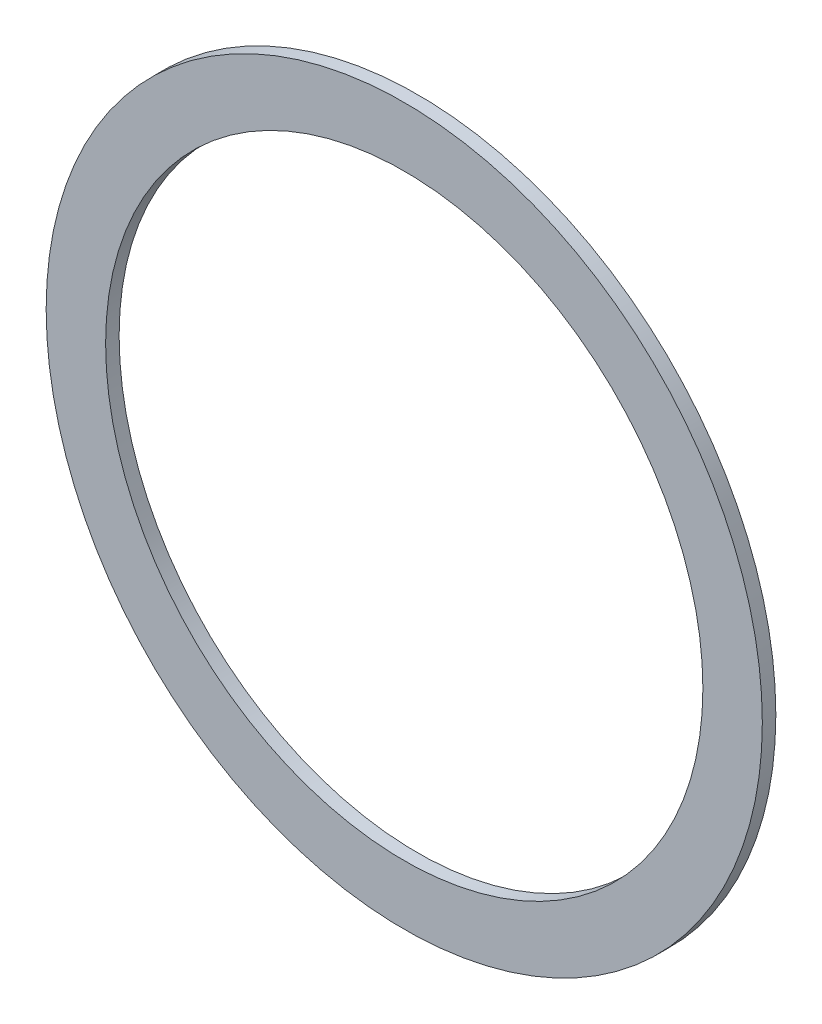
ISO-10303-21;
HEADER;
FILE_DESCRIPTION(('STEP AP214'),'2;1');
FILE_NAME('part.step','',(''),(''),'','','');
FILE_SCHEMA(('AUTOMOTIVE_DESIGN { 1 0 10303 214 1 1 1 1 }'));
ENDSEC;
DATA;
#1=APPLICATION_CONTEXT('core data for automotive mechanical design processes');
#2=APPLICATION_PROTOCOL_DEFINITION('international standard','automotive_design',2000,#1);
#3=PRODUCT_CONTEXT('',#1,'mechanical');
#4=PRODUCT('Part','Part','',(#3));
#5=PRODUCT_RELATED_PRODUCT_CATEGORY('part','',(#4));
#6=PRODUCT_DEFINITION_FORMATION('','',#4);
#7=PRODUCT_DEFINITION_CONTEXT('part definition',#1,'design');
#8=PRODUCT_DEFINITION('design','',#6,#7);
#9=PRODUCT_DEFINITION_SHAPE('','',#8);
#10=(LENGTH_UNIT() NAMED_UNIT(*) SI_UNIT(.MILLI.,.METRE.));
#11=(NAMED_UNIT(*) PLANE_ANGLE_UNIT() SI_UNIT($,.RADIAN.));
#12=(NAMED_UNIT(*) SI_UNIT($,.STERADIAN.) SOLID_ANGLE_UNIT());
#13=UNCERTAINTY_MEASURE_WITH_UNIT(LENGTH_MEASURE(1.E-05),#10,'distance_accuracy_value','');
#14=(GEOMETRIC_REPRESENTATION_CONTEXT(3) GLOBAL_UNCERTAINTY_ASSIGNED_CONTEXT((#13)) GLOBAL_UNIT_ASSIGNED_CONTEXT((#10,
#11,#12)) REPRESENTATION_CONTEXT('',''));
#15=CARTESIAN_POINT('',(0.,0.,0.));
#16=DIRECTION('',(0.,0.,1.));
#17=DIRECTION('',(1.,0.,0.));
#18=AXIS2_PLACEMENT_3D('',#15,#16,#17);
#19=CARTESIAN_POINT('',(0.,0.,0.5));
#20=DIRECTION('',(0.,0.,1.));
#21=DIRECTION('',(1.,0.,0.));
#22=AXIS2_PLACEMENT_3D('',#19,#20,#21);
#23=PLANE('',#22);
#24=CARTESIAN_POINT('',(0.,0.,0.5));
#25=DIRECTION('',(0.,0.,1.));
#26=DIRECTION('',(1.,0.,0.));
#27=AXIS2_PLACEMENT_3D('',#24,#25,#26);
#28=CIRCLE('',#27,13.25);
#29=CARTESIAN_POINT('',(13.25,0.,0.5));
#30=VERTEX_POINT('',#29);
#31=EDGE_CURVE('E10',#30,#30,#28,.T.);
#32=ORIENTED_EDGE('',*,*,#31,.T.);
#33=EDGE_LOOP('',(#32));
#34=FACE_BOUND('',#33,.T.);
#35=CARTESIAN_POINT('',(0.,0.,0.5));
#36=DIRECTION('',(0.,0.,1.));
#37=DIRECTION('',(1.,0.,0.));
#38=AXIS2_PLACEMENT_3D('',#35,#36,#37);
#39=CIRCLE('',#38,11.05);
#40=CARTESIAN_POINT('',(11.05,0.,0.5));
#41=VERTEX_POINT('',#40);
#42=EDGE_CURVE('E25',#41,#41,#39,.T.);
#43=ORIENTED_EDGE('',*,*,#42,.F.);
#44=EDGE_LOOP('',(#43));
#45=FACE_BOUND('',#44,.T.);
#46=ADVANCED_FACE('F14',(#34,#45),#23,.T.);
#47=CARTESIAN_POINT('',(0.,0.,0.));
#48=DIRECTION('',(0.,0.,1.));
#49=DIRECTION('',(1.,0.,0.));
#50=AXIS2_PLACEMENT_3D('',#47,#48,#49);
#51=PLANE('',#50);
#52=CARTESIAN_POINT('',(0.,0.,0.));
#53=DIRECTION('',(0.,0.,1.));
#54=DIRECTION('',(1.,0.,0.));
#55=AXIS2_PLACEMENT_3D('',#52,#53,#54);
#56=CIRCLE('',#55,13.25);
#57=CARTESIAN_POINT('',(13.25,0.,0.));
#58=VERTEX_POINT('',#57);
#59=EDGE_CURVE('E18',#58,#58,#56,.T.);
#60=ORIENTED_EDGE('',*,*,#59,.F.);
#61=EDGE_LOOP('',(#60));
#62=FACE_BOUND('',#61,.T.);
#63=CARTESIAN_POINT('',(0.,0.,0.));
#64=DIRECTION('',(0.,0.,1.));
#65=DIRECTION('',(1.,0.,0.));
#66=AXIS2_PLACEMENT_3D('',#63,#64,#65);
#67=CIRCLE('',#66,11.05);
#68=CARTESIAN_POINT('',(11.05,0.,0.));
#69=VERTEX_POINT('',#68);
#70=EDGE_CURVE('E27',#69,#69,#67,.T.);
#71=ORIENTED_EDGE('',*,*,#70,.T.);
#72=EDGE_LOOP('',(#71));
#73=FACE_BOUND('',#72,.T.);
#74=ADVANCED_FACE('F37',(#62,#73),#51,.F.);
#75=CARTESIAN_POINT('',(0.,0.,0.5));
#76=DIRECTION('',(0.,0.,-1.));
#77=DIRECTION('',(-1.,0.,0.));
#78=AXIS2_PLACEMENT_3D('',#75,#76,#77);
#79=CYLINDRICAL_SURFACE('',#78,13.25);
#80=ORIENTED_EDGE('',*,*,#31,.F.);
#81=EDGE_LOOP('',(#80));
#82=FACE_BOUND('',#81,.T.);
#83=ORIENTED_EDGE('',*,*,#59,.T.);
#84=EDGE_LOOP('',(#83));
#85=FACE_BOUND('',#84,.T.);
#86=ADVANCED_FACE('F16',(#82,#85),#79,.T.);
#87=CARTESIAN_POINT('',(0.,0.,0.5));
#88=DIRECTION('',(0.,0.,-1.));
#89=DIRECTION('',(-1.,0.,0.));
#90=AXIS2_PLACEMENT_3D('',#87,#88,#89);
#91=CYLINDRICAL_SURFACE('',#90,11.05);
#92=ORIENTED_EDGE('',*,*,#42,.T.);
#93=EDGE_LOOP('',(#92));
#94=FACE_BOUND('',#93,.T.);
#95=ORIENTED_EDGE('',*,*,#70,.F.);
#96=EDGE_LOOP('',(#95));
#97=FACE_BOUND('',#96,.T.);
#98=ADVANCED_FACE('F33',(#94,#97),#91,.F.);
#99=CLOSED_SHELL('',(#46,#74,#86,#98));
#100=MANIFOLD_SOLID_BREP('B1',#99);
#101=ADVANCED_BREP_SHAPE_REPRESENTATION('',(#18,#100),#14);
#102=SHAPE_DEFINITION_REPRESENTATION(#9,#101);
ENDSEC;
END-ISO-10303-21;
